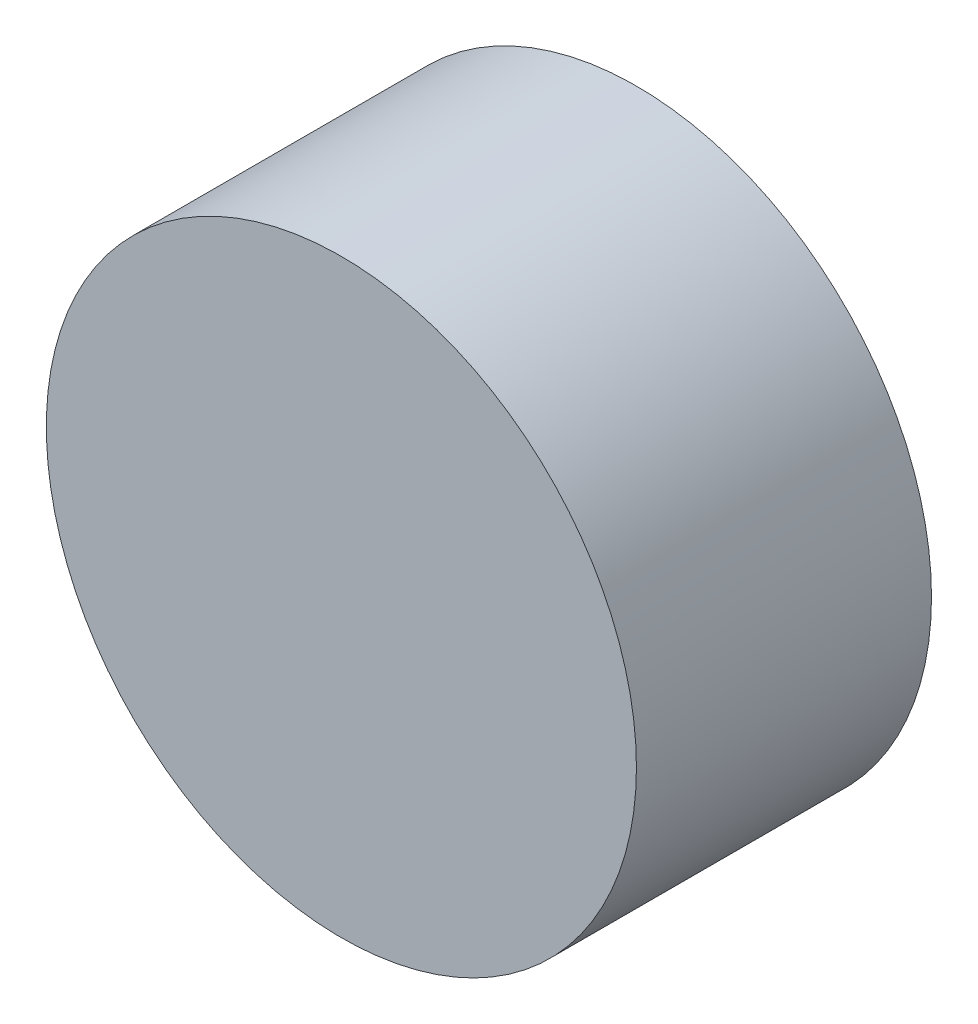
ISO-10303-21;
HEADER;
FILE_DESCRIPTION(('STEP AP214'),'2;1');
FILE_NAME('part.step','',(''),(''),'','','');
FILE_SCHEMA(('AUTOMOTIVE_DESIGN { 1 0 10303 214 1 1 1 1 }'));
ENDSEC;
DATA;
#1=APPLICATION_CONTEXT('core data for automotive mechanical design processes');
#2=APPLICATION_PROTOCOL_DEFINITION('international standard','automotive_design',2000,#1);
#3=PRODUCT_CONTEXT('',#1,'mechanical');
#4=PRODUCT('Part','Part','',(#3));
#5=PRODUCT_RELATED_PRODUCT_CATEGORY('part','',(#4));
#6=PRODUCT_DEFINITION_FORMATION('','',#4);
#7=PRODUCT_DEFINITION_CONTEXT('part definition',#1,'design');
#8=PRODUCT_DEFINITION('design','',#6,#7);
#9=PRODUCT_DEFINITION_SHAPE('','',#8);
#10=(LENGTH_UNIT() NAMED_UNIT(*) SI_UNIT(.MILLI.,.METRE.));
#11=(NAMED_UNIT(*) PLANE_ANGLE_UNIT() SI_UNIT($,.RADIAN.));
#12=(NAMED_UNIT(*) SI_UNIT($,.STERADIAN.) SOLID_ANGLE_UNIT());
#13=UNCERTAINTY_MEASURE_WITH_UNIT(LENGTH_MEASURE(1.E-05),#10,'distance_accuracy_value','');
#14=(GEOMETRIC_REPRESENTATION_CONTEXT(3) GLOBAL_UNCERTAINTY_ASSIGNED_CONTEXT((#13)) GLOBAL_UNIT_ASSIGNED_CONTEXT((#10,
#11,#12)) REPRESENTATION_CONTEXT('',''));
#15=CARTESIAN_POINT('',(0.,0.,0.));
#16=DIRECTION('',(0.,0.,1.));
#17=DIRECTION('',(1.,0.,0.));
#18=AXIS2_PLACEMENT_3D('',#15,#16,#17);
#19=CARTESIAN_POINT('',(0.,0.,25.4));
#20=DIRECTION('',(0.,0.,-1.));
#21=DIRECTION('',(-1.,0.,0.));
#22=AXIS2_PLACEMENT_3D('',#19,#20,#21);
#23=CYLINDRICAL_SURFACE('',#22,25.4);
#24=CARTESIAN_POINT('',(0.,0.,25.4));
#25=DIRECTION('',(0.,0.,1.));
#26=DIRECTION('',(1.,0.,0.));
#27=AXIS2_PLACEMENT_3D('',#24,#25,#26);
#28=CIRCLE('',#27,25.4);
#29=CARTESIAN_POINT('',(25.4,0.,25.4));
#30=VERTEX_POINT('',#29);
#31=EDGE_CURVE('E10',#30,#30,#28,.T.);
#32=ORIENTED_EDGE('',*,*,#31,.F.);
#33=EDGE_LOOP('',(#32));
#34=FACE_BOUND('',#33,.T.);
#35=CARTESIAN_POINT('',(0.,0.,0.));
#36=DIRECTION('',(0.,0.,1.));
#37=DIRECTION('',(1.,0.,0.));
#38=AXIS2_PLACEMENT_3D('',#35,#36,#37);
#39=CIRCLE('',#38,25.4);
#40=CARTESIAN_POINT('',(25.4,0.,0.));
#41=VERTEX_POINT('',#40);
#42=EDGE_CURVE('E30',#41,#41,#39,.T.);
#43=ORIENTED_EDGE('',*,*,#42,.T.);
#44=EDGE_LOOP('',(#43));
#45=FACE_BOUND('',#44,.T.);
#46=ADVANCED_FACE('F24',(#34,#45),#23,.T.);
#47=CARTESIAN_POINT('',(0.,0.,25.4));
#48=DIRECTION('',(0.,0.,1.));
#49=DIRECTION('',(1.,0.,0.));
#50=AXIS2_PLACEMENT_3D('',#47,#48,#49);
#51=PLANE('',#50);
#52=ORIENTED_EDGE('',*,*,#31,.T.);
#53=EDGE_LOOP('',(#52));
#54=FACE_BOUND('',#53,.T.);
#55=ADVANCED_FACE('F39',(#54),#51,.T.);
#56=CARTESIAN_POINT('',(0.,0.,0.));
#57=DIRECTION('',(0.,0.,1.));
#58=DIRECTION('',(1.,0.,0.));
#59=AXIS2_PLACEMENT_3D('',#56,#57,#58);
#60=PLANE('',#59);
#61=ORIENTED_EDGE('',*,*,#42,.F.);
#62=EDGE_LOOP('',(#61));
#63=FACE_BOUND('',#62,.T.);
#64=ADVANCED_FACE('F37',(#63),#60,.F.);
#65=CLOSED_SHELL('',(#46,#55,#64));
#66=MANIFOLD_SOLID_BREP('B2',#65);
#67=ADVANCED_BREP_SHAPE_REPRESENTATION('',(#18,#66),#14);
#68=SHAPE_DEFINITION_REPRESENTATION(#9,#67);
ENDSEC;
END-ISO-10303-21;
